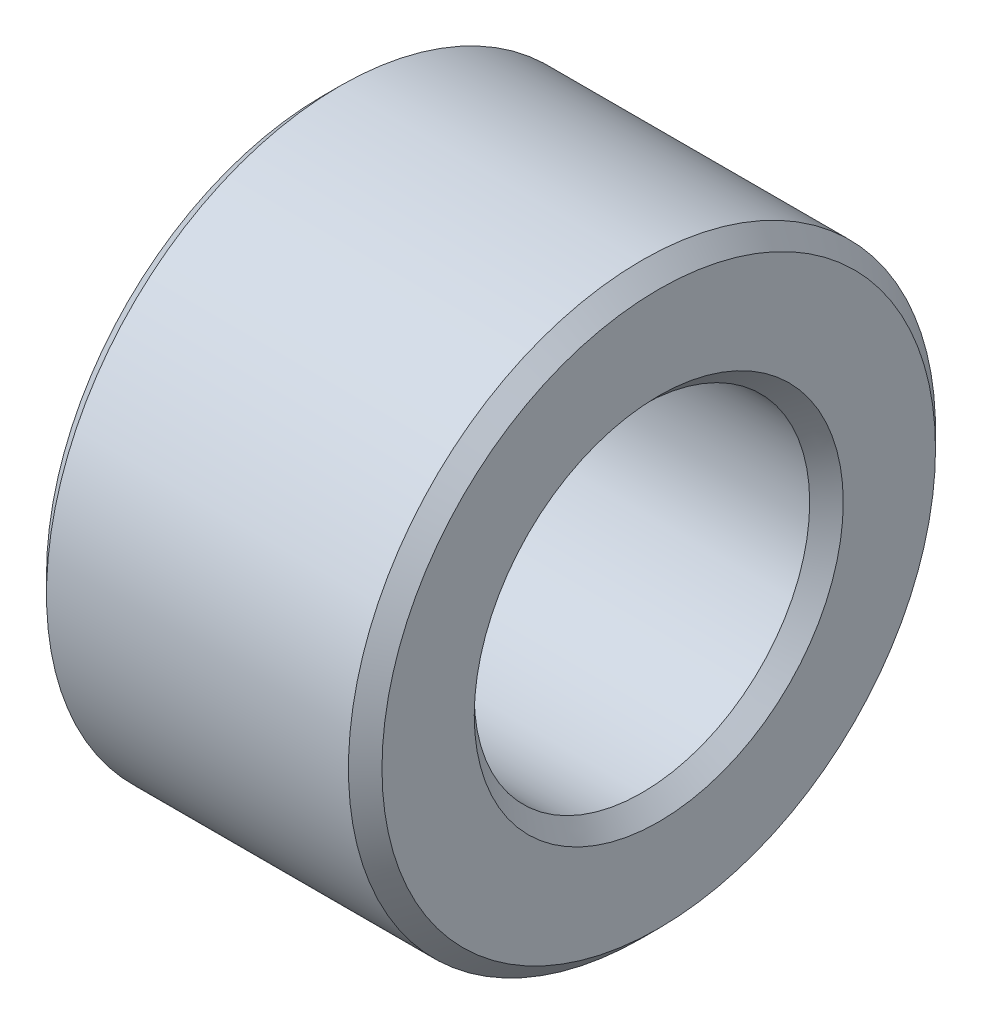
ISO-10303-21;
HEADER;
FILE_DESCRIPTION(('STEP AP214'),'2;1');
FILE_NAME('part.step','',(''),(''),'','','');
FILE_SCHEMA(('AUTOMOTIVE_DESIGN { 1 0 10303 214 1 1 1 1 }'));
ENDSEC;
DATA;
#1=APPLICATION_CONTEXT('core data for automotive mechanical design processes');
#2=APPLICATION_PROTOCOL_DEFINITION('international standard','automotive_design',2000,#1);
#3=PRODUCT_CONTEXT('',#1,'mechanical');
#4=PRODUCT('Part','Part','',(#3));
#5=PRODUCT_RELATED_PRODUCT_CATEGORY('part','',(#4));
#6=PRODUCT_DEFINITION_FORMATION('','',#4);
#7=PRODUCT_DEFINITION_CONTEXT('part definition',#1,'design');
#8=PRODUCT_DEFINITION('design','',#6,#7);
#9=PRODUCT_DEFINITION_SHAPE('','',#8);
#10=(LENGTH_UNIT() NAMED_UNIT(*) SI_UNIT(.MILLI.,.METRE.));
#11=(NAMED_UNIT(*) PLANE_ANGLE_UNIT() SI_UNIT($,.RADIAN.));
#12=(NAMED_UNIT(*) SI_UNIT($,.STERADIAN.) SOLID_ANGLE_UNIT());
#13=UNCERTAINTY_MEASURE_WITH_UNIT(LENGTH_MEASURE(1.E-05),#10,'distance_accuracy_value','');
#14=(GEOMETRIC_REPRESENTATION_CONTEXT(3) GLOBAL_UNCERTAINTY_ASSIGNED_CONTEXT((#13)) GLOBAL_UNIT_ASSIGNED_CONTEXT((#10,
#11,#12)) REPRESENTATION_CONTEXT('',''));
#15=CARTESIAN_POINT('',(0.,0.,0.));
#16=DIRECTION('',(0.,0.,1.));
#17=DIRECTION('',(1.,0.,0.));
#18=AXIS2_PLACEMENT_3D('',#15,#16,#17);
#19=CARTESIAN_POINT('',(0.,-5.5,0.));
#20=DIRECTION('',(-1.,0.,0.));
#21=DIRECTION('',(0.,1.,0.));
#22=AXIS2_PLACEMENT_3D('',#19,#20,#21);
#23=PLANE('',#22);
#24=CARTESIAN_POINT('',(0.,0.,0.));
#25=DIRECTION('',(1.,0.,0.));
#26=DIRECTION('',(0.,-1.,0.));
#27=AXIS2_PLACEMENT_3D('',#24,#25,#26);
#28=CIRCLE('',#27,4.4);
#29=CARTESIAN_POINT('',(0.,-4.4,0.));
#30=VERTEX_POINT('',#29);
#31=EDGE_CURVE('E10',#30,#30,#28,.T.);
#32=ORIENTED_EDGE('',*,*,#31,.T.);
#33=EDGE_LOOP('',(#32));
#34=FACE_BOUND('',#33,.T.);
#35=CARTESIAN_POINT('',(0.,0.,0.));
#36=DIRECTION('',(1.,0.,0.));
#37=DIRECTION('',(0.,-1.,0.));
#38=AXIS2_PLACEMENT_3D('',#35,#36,#37);
#39=CIRCLE('',#38,6.6);
#40=CARTESIAN_POINT('',(0.,-6.6,0.));
#41=VERTEX_POINT('',#40);
#42=EDGE_CURVE('E54',#41,#41,#39,.T.);
#43=ORIENTED_EDGE('',*,*,#42,.F.);
#44=EDGE_LOOP('',(#43));
#45=FACE_BOUND('',#44,.T.);
#46=ADVANCED_FACE('F16',(#34,#45),#23,.T.);
#47=CARTESIAN_POINT('',(0.2,0.,0.));
#48=DIRECTION('',(-1.,0.,0.));
#49=DIRECTION('',(0.,-1.,0.));
#50=AXIS2_PLACEMENT_3D('',#47,#48,#49);
#51=CONICAL_SURFACE('',#50,4.2,0.785398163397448);
#52=CARTESIAN_POINT('',(0.4,0.,0.));
#53=DIRECTION('',(1.,0.,0.));
#54=DIRECTION('',(0.,-1.,0.));
#55=AXIS2_PLACEMENT_3D('',#52,#53,#54);
#56=CIRCLE('',#55,4.);
#57=CARTESIAN_POINT('',(0.4,-4.,0.));
#58=VERTEX_POINT('',#57);
#59=EDGE_CURVE('E23',#58,#58,#56,.T.);
#60=ORIENTED_EDGE('',*,*,#59,.T.);
#61=EDGE_LOOP('',(#60));
#62=FACE_BOUND('',#61,.T.);
#63=ORIENTED_EDGE('',*,*,#31,.F.);
#64=EDGE_LOOP('',(#63));
#65=FACE_BOUND('',#64,.T.);
#66=ADVANCED_FACE('F83',(#62,#65),#51,.F.);
#67=CARTESIAN_POINT('',(4.,0.,0.));
#68=DIRECTION('',(-1.,0.,0.));
#69=DIRECTION('',(0.,-1.,0.));
#70=AXIS2_PLACEMENT_3D('',#67,#68,#69);
#71=CYLINDRICAL_SURFACE('',#70,4.);
#72=CARTESIAN_POINT('',(7.6,0.,0.));
#73=DIRECTION('',(1.,0.,0.));
#74=DIRECTION('',(0.,-1.,0.));
#75=AXIS2_PLACEMENT_3D('',#72,#73,#74);
#76=CIRCLE('',#75,4.);
#77=CARTESIAN_POINT('',(7.6,-4.,0.));
#78=VERTEX_POINT('',#77);
#79=EDGE_CURVE('E59',#78,#78,#76,.T.);
#80=ORIENTED_EDGE('',*,*,#79,.T.);
#81=EDGE_LOOP('',(#80));
#82=FACE_BOUND('',#81,.T.);
#83=ORIENTED_EDGE('',*,*,#59,.F.);
#84=EDGE_LOOP('',(#83));
#85=FACE_BOUND('',#84,.T.);
#86=ADVANCED_FACE('F67',(#82,#85),#71,.F.);
#87=CARTESIAN_POINT('',(7.8,0.,0.));
#88=DIRECTION('',(1.,0.,0.));
#89=DIRECTION('',(0.,-1.,0.));
#90=AXIS2_PLACEMENT_3D('',#87,#88,#89);
#91=CONICAL_SURFACE('',#90,4.2,0.78539816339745);
#92=CARTESIAN_POINT('',(8.,0.,0.));
#93=DIRECTION('',(1.,0.,0.));
#94=DIRECTION('',(0.,-1.,0.));
#95=AXIS2_PLACEMENT_3D('',#92,#93,#94);
#96=CIRCLE('',#95,4.4);
#97=CARTESIAN_POINT('',(8.,-4.4,0.));
#98=VERTEX_POINT('',#97);
#99=EDGE_CURVE('E64',#98,#98,#96,.T.);
#100=ORIENTED_EDGE('',*,*,#99,.T.);
#101=EDGE_LOOP('',(#100));
#102=FACE_BOUND('',#101,.T.);
#103=ORIENTED_EDGE('',*,*,#79,.F.);
#104=EDGE_LOOP('',(#103));
#105=FACE_BOUND('',#104,.T.);
#106=ADVANCED_FACE('F70',(#102,#105),#91,.F.);
#107=CARTESIAN_POINT('',(8.,-5.5,0.));
#108=DIRECTION('',(1.,0.,0.));
#109=DIRECTION('',(0.,-1.,0.));
#110=AXIS2_PLACEMENT_3D('',#107,#108,#109);
#111=PLANE('',#110);
#112=CARTESIAN_POINT('',(8.,0.,0.));
#113=DIRECTION('',(1.,0.,0.));
#114=DIRECTION('',(0.,-1.,0.));
#115=AXIS2_PLACEMENT_3D('',#112,#113,#114);
#116=CIRCLE('',#115,6.6);
#117=CARTESIAN_POINT('',(8.,-6.6,0.));
#118=VERTEX_POINT('',#117);
#119=EDGE_CURVE('E62',#118,#118,#116,.T.);
#120=ORIENTED_EDGE('',*,*,#119,.T.);
#121=EDGE_LOOP('',(#120));
#122=FACE_BOUND('',#121,.T.);
#123=ORIENTED_EDGE('',*,*,#99,.F.);
#124=EDGE_LOOP('',(#123));
#125=FACE_BOUND('',#124,.T.);
#126=ADVANCED_FACE('F72',(#122,#125),#111,.T.);
#127=CARTESIAN_POINT('',(7.8,0.,0.));
#128=DIRECTION('',(-1.,0.,0.));
#129=DIRECTION('',(0.,-1.,0.));
#130=AXIS2_PLACEMENT_3D('',#127,#128,#129);
#131=CONICAL_SURFACE('',#130,6.8,0.785398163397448);
#132=CARTESIAN_POINT('',(7.6,0.,0.));
#133=DIRECTION('',(1.,0.,0.));
#134=DIRECTION('',(0.,-1.,0.));
#135=AXIS2_PLACEMENT_3D('',#132,#133,#134);
#136=CIRCLE('',#135,7.);
#137=CARTESIAN_POINT('',(7.6,-7.,0.));
#138=VERTEX_POINT('',#137);
#139=EDGE_CURVE('E56',#138,#138,#136,.T.);
#140=ORIENTED_EDGE('',*,*,#139,.T.);
#141=EDGE_LOOP('',(#140));
#142=FACE_BOUND('',#141,.T.);
#143=ORIENTED_EDGE('',*,*,#119,.F.);
#144=EDGE_LOOP('',(#143));
#145=FACE_BOUND('',#144,.T.);
#146=ADVANCED_FACE('F80',(#142,#145),#131,.T.);
#147=CARTESIAN_POINT('',(4.,0.,0.));
#148=DIRECTION('',(-1.,0.,0.));
#149=DIRECTION('',(0.,-1.,0.));
#150=AXIS2_PLACEMENT_3D('',#147,#148,#149);
#151=CYLINDRICAL_SURFACE('',#150,7.);
#152=CARTESIAN_POINT('',(0.4,0.,0.));
#153=DIRECTION('',(1.,0.,0.));
#154=DIRECTION('',(0.,-1.,0.));
#155=AXIS2_PLACEMENT_3D('',#152,#153,#154);
#156=CIRCLE('',#155,7.);
#157=CARTESIAN_POINT('',(0.4,-7.,0.));
#158=VERTEX_POINT('',#157);
#159=EDGE_CURVE('E50',#158,#158,#156,.T.);
#160=ORIENTED_EDGE('',*,*,#159,.T.);
#161=EDGE_LOOP('',(#160));
#162=FACE_BOUND('',#161,.T.);
#163=ORIENTED_EDGE('',*,*,#139,.F.);
#164=EDGE_LOOP('',(#163));
#165=FACE_BOUND('',#164,.T.);
#166=ADVANCED_FACE('F51',(#162,#165),#151,.T.);
#167=CARTESIAN_POINT('',(0.2,0.,0.));
#168=DIRECTION('',(1.,0.,0.));
#169=DIRECTION('',(0.,-1.,0.));
#170=AXIS2_PLACEMENT_3D('',#167,#168,#169);
#171=CONICAL_SURFACE('',#170,6.8,0.785398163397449);
#172=ORIENTED_EDGE('',*,*,#42,.T.);
#173=EDGE_LOOP('',(#172));
#174=FACE_BOUND('',#173,.T.);
#175=ORIENTED_EDGE('',*,*,#159,.F.);
#176=EDGE_LOOP('',(#175));
#177=FACE_BOUND('',#176,.T.);
#178=ADVANCED_FACE('F93',(#174,#177),#171,.T.);
#179=CLOSED_SHELL('',(#46,#66,#86,#106,#126,#146,#166,#178));
#180=MANIFOLD_SOLID_BREP('B1',#179);
#181=ADVANCED_BREP_SHAPE_REPRESENTATION('',(#18,#180),#14);
#182=SHAPE_DEFINITION_REPRESENTATION(#9,#181);
ENDSEC;
END-ISO-10303-21;
